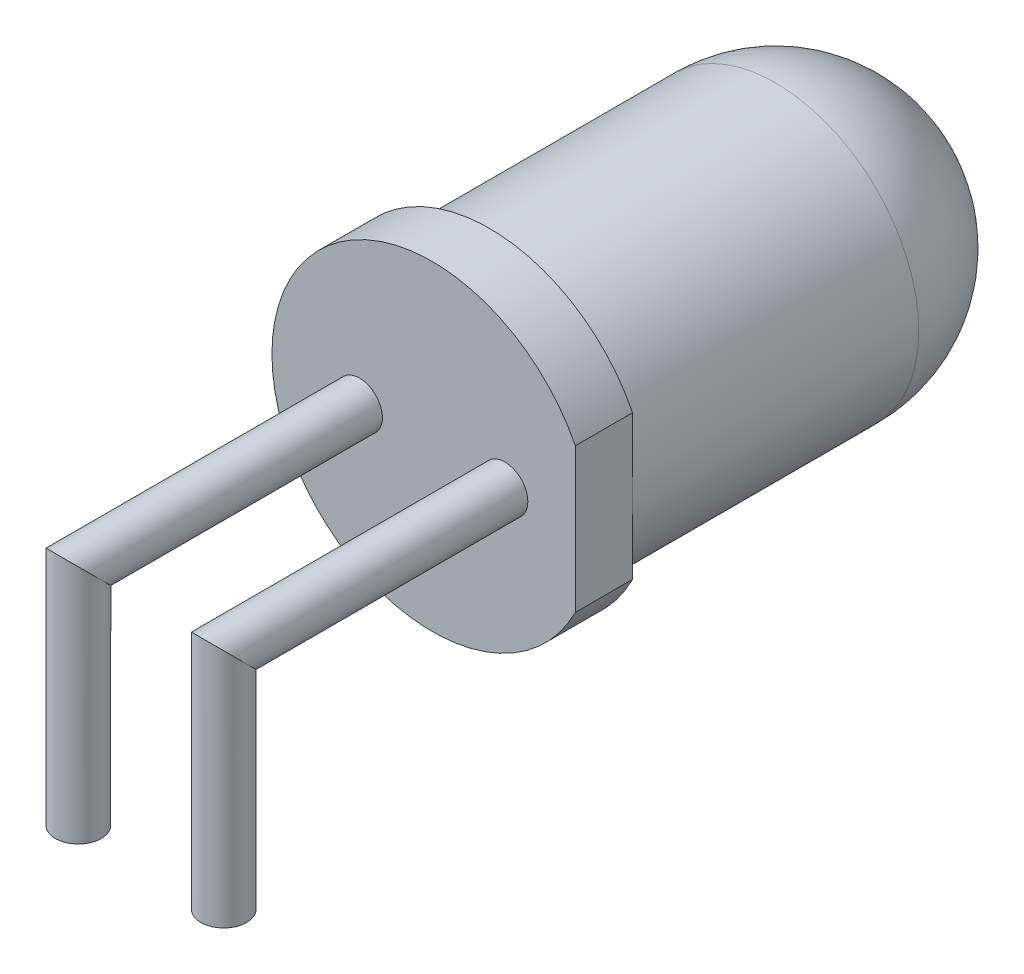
from build123d import *

# Parameters (mm, degrees)
ESQUISSE1_R          = 2.5
BASE_EXTRUSION_DEPTH = 8.5
BOSS_EXTRU_1_DEPTH   = 1
CONG_1_R             = 2.5
ESQUISSE3_R          = 0.4


with BuildPart() as part:
    # Esquisse1 → Base-Extrusion (new body)
    with BuildSketch(Plane.XY):
        Circle(ESQUISSE1_R)
    extrude(amount=BASE_EXTRUSION_DEPTH)

    # Esquisse2 → Boss.-Extru.1 (add)
    with BuildSketch(Plane.XY.offset(8.5)):
        with BuildLine():
            Line((2.5, 1.260952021), (2.5, -1.260952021))
            ThreePointArc((2.5, -1.260952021), (-2.8, 0), (2.5, 1.260952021))
        make_face()
    extrude(amount=-BOSS_EXTRU_1_DEPTH)

    # Cong_1
    cong_1_edges = [part.edges().sort_by_distance(p)[0] for p in [
        (-2.5, 0, 0),
    ]]
    fillet(cong_1_edges, radius=CONG_1_R)

    # Balayage1: sweep along a path in Esquisse4
    with BuildLine(Plane(origin=(0, 0, 0), x_dir=(0, 0, -1), z_dir=(1, 0, 0))) as balayage1_path:
        Line((-8.5, 0.088362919), (-13.5, 0.088362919))
        Line((-13.5, 0.088362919), (-13.5, -3.911637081))
    # Esquisse3 → Balayage1 (sweep)
    with BuildSketch(Plane.XY.offset(8.5)):
        with Locations((-1.27, 0)):
            Circle(ESQUISSE3_R)
        with Locations((1.27, 0)):
            Circle(ESQUISSE3_R)
    sweep(path=balayage1_path.line, transition=Transition.RIGHT)


solid = part.part
